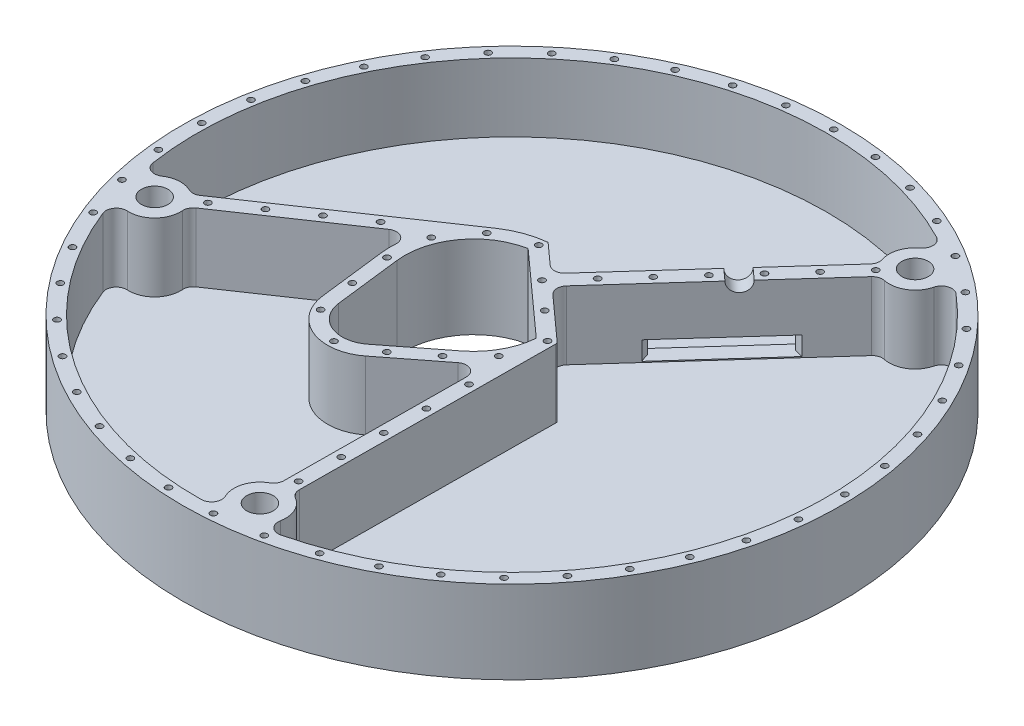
from build123d import *

# Parameters (mm, degrees)
SKETCH1_R                                        = 201.93
EXTRUDE1_DEPTH                                   = 50.8
SHELL2_T                                         = -8.89
SKETCH3_R                                        = 15.875
EXTRUDE2_DEPTH                                   = 50.8
EXTRUDE3_DEPTH                                   = 50.8
CSK_FOR_1_4_FLAT_HEAD_MACHINE_SCREW1_D           = 6.7564
CSK_FOR_1_4_FLAT_HEAD_MACHINE_SCREW1_CSINK_D     = 13.7610088
CSK_FOR_1_4_FLAT_HEAD_MACHINE_SCREW1_CSINK_ANGLE = 82
SKETCH8_R                                        = 8.128
CUT_EXTRUDE1_DEPTH                               = 25.4
FILLET1_R                                        = 6.35
CUT_EXTRUDE2_DEPTH                               = 6.35
CIRPATTERN1_COUNT                                = 45
LPATTERN1_COUNT                                  = 7
LPATTERN1_PITCH                                  = 24.13
LPATTERN2_COUNT                                  = 3
LPATTERN2_PITCH                                  = 22.8092
CIRPATTERN2_COUNT                                = 4
CIRPATTERN2_ANGLE                                = 90
F_10_24_TAPPED_HOLE5_D                           = 3.7973
F_10_24_TAPPED_HOLE5_DEPTH                       = 15.875
F_10_24_TAPPED_HOLE5_TIP                         = 1.140824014
F_10_24_TAPPED_HOLE6_D                           = 3.7973
F_10_24_TAPPED_HOLE6_DEPTH                       = 15.875
F_10_24_TAPPED_HOLE6_TIP                         = 1.140824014
F_10_24_TAPPED_HOLE7_D                           = 3.7973
F_10_24_TAPPED_HOLE7_DEPTH                       = 15.875
F_10_24_TAPPED_HOLE7_TIP                         = 1.140824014
LPATTERN3_COUNT                                  = 2
LPATTERN3_PITCH                                  = 5.08
CUT_EXTRUDE3_REACH                               = 312.437
SKETCH19_R                                       = 6.35


with BuildPart() as part:
    # Sketch1 → Extrude1 (new body)
    with BuildSketch(Plane(origin=(0, 0, 0), x_dir=(1, 0, 0), z_dir=(0, 1, 0))):
        with Locations(Location((0, 0, 0), (0, 0, 270))):
            Circle(SKETCH1_R)
        with BuildLine():
            Line((-28.742331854, -59.600703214), (3.565135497, -34.452889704))
            ThreePointArc((3.565135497, -34.452889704), (14.713381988, -21.319783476), (19.685, -4.826))
            Line((19.685, -4.826), (-30.409061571, 40.278895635))
            ThreePointArc((-30.409061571, 40.278895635), (-56.473748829, 23.694860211), (-64.257839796, -6.201729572))
            Line((-64.257839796, -6.201729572), (-59.356637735, -46.848539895))
            ThreePointArc((-59.356637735, -46.848539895), (-47.768699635, -62.153395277), (-28.742331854, -59.600703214))
        make_face(mode=Mode.SUBTRACT)
    extrude(amount=EXTRUDE1_DEPTH)

    # Shell2
    shell2_openings = [part.faces().sort_by_distance(p)[0] for p in [
        (0, 50.8, -196.218557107),
    ]]
    offset(amount=SHELL2_T, openings=shell2_openings, kind=Kind.INTERSECTION)

    # Sketch3 → Extrude2 (add)
    with BuildSketch(Plane(origin=(0, 50.8, 0), x_dir=(1, 0, 0), z_dir=(0, 1, 0))):
        with Locations((98.989124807, 148.001284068)):
            Circle(SKETCH3_R)
        with Locations((-172.232971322, -46.720317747)):
            Circle(SKETCH3_R)
        with Locations((22.585028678, -177.022317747)):
            Circle(SKETCH3_R)
    extrude(amount=-EXTRUDE2_DEPTH)

    # Sketch6 → Extrude3 (add)
    with BuildSketch(Plane(origin=(0, 0, 0), x_dir=(1, 0, 0), z_dir=(0, 1, 0))):
        Polygon((-10.103864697, 33.958689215), (85.316727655, 139.933993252), (92.395182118, 133.560524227), (-3.025410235, 27.58522019), align=None)
        Polygon((-51.014363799, 41.151219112), (-162.366417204, -34.283809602), (-157.024193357, -42.169636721), (-70.268175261, 16.602900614), align=None)
        Polygon((28.735263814, -1.012219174), (27.466763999, -161.916547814), (17.942059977, -161.841459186), (18.972068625, -31.188818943), align=None)
    extrude(amount=EXTRUDE3_DEPTH)

    # CSK for 1_4 Flat Head Machine Screw1 (through all)
    with Locations(Plane(origin=(22.585028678, 0, 177.022317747), x_dir=(0, 0, -1), z_dir=(0, -1, 0))):
        with Locations((0, 0), (130.302, -194.818), (325.023601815, 76.404096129)):
            CounterSinkHole(CSK_FOR_1_4_FLAT_HEAD_MACHINE_SCREW1_D / 2, CSK_FOR_1_4_FLAT_HEAD_MACHINE_SCREW1_CSINK_D / 2, counter_sink_angle=CSK_FOR_1_4_FLAT_HEAD_MACHINE_SCREW1_CSINK_ANGLE)

    # Sketch8 → Cut-Extrude1 (cut)
    with BuildSketch(Plane(origin=(0, 50.8, 0), x_dir=(1, 0, 0), z_dir=(0, 1, 0))):
        with Locations(Location((98.989124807, 148.001284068, 0), (0, 0, 270))):
            Circle(SKETCH8_R)
        with Locations(Location((22.585028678, -177.022317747, 0), (0, 0, 270))):
            Circle(SKETCH8_R)
        with Locations(Location((-172.232971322, -46.720317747, 0), (0, 0, 270))):
            Circle(SKETCH8_R)
    extrude(amount=-CUT_EXTRUDE1_DEPTH, mode=Mode.SUBTRACT)

    # Fillet1
    fillet1_edges = [part.edges().sort_by_distance(p)[0] for p in [
        (30.888171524, 29.845, 190.552781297),
        (17.945078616, 29.845, 192.204099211),
        (-70.268175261, 29.845, -16.602900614),
        (18.972068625, 29.845, 31.188818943),
        (-184.492696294, 29.845, 56.805691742),
        (-187.90868034, 29.845, 44.21277477),
        (102.744881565, 29.845, -163.425612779),
        (111.810638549, 29.845, -157.362075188),
        (85.316727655, 29.845, -139.933993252),
        (-162.366417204, 29.845, 34.283809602),
        (-10.103864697, 29.845, -33.958689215),
        (17.942059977, 29.845, 161.841459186),
        (27.466763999, 29.845, 161.916547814),
        (-3.025410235, 29.845, -27.58522019),
        (-157.024193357, 29.845, 42.169636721),
        (92.395182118, 29.845, -133.560524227),
    ]]
    fillet(fillet1_edges, radius=FILLET1_R)

    # Sketch10 → Cut-Extrude2 (cut)
    with BuildSketch(Plane(origin=(0, 15.875, 0), x_dir=(-1, 0, 0), z_dir=(0, 1, 0))):
        with BuildLine():
            ThreePointArc((-21.239017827, -61.651042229), (-86.279612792, -46.293923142), (-64.20802817, -109.372962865))
            ThreePointArc((-64.20802817, -109.372962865), (0.832566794, -124.730081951), (-21.239017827, -61.651042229))
        make_face()
    cut_extrude2 = extrude(amount=-CUT_EXTRUDE2_DEPTH, mode=Mode.SUBTRACT)

    # Sketch11 → 10-24 Tapped Hole1 (revolve, cut)
    with BuildSketch(Plane(origin=(0, 50.8, -197.1675), x_dir=(0, 0, 1), z_dir=(1, 0, 0))):
        Polygon((0, 0), (0, 17.015824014), (1.89865, 15.875), (1.89865, 0), align=None)
    f_10_24_tapped_hole1 = revolve(axis=Axis((0, 57.15, -197.1675), (0, -1, 0)), mode=Mode.SUBTRACT)

    # CirPattern1: 10-24 Tapped Hole1 ×45 about axis
    cirpattern1_axis = Axis((0, 0, 0), (0, 1, 0))
    for i in range(1, CIRPATTERN1_COUNT):
        add(f_10_24_tapped_hole1.rotate(cirpattern1_axis, i * 360 / CIRPATTERN1_COUNT), mode=Mode.SUBTRACT)

    # Sketch13 → 10-24 Tapped Hole2 (revolve, cut)
    with BuildSketch(Plane(origin=(-9.326474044, 50.8, -27.704624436), x_dir=(0, 0, 1), z_dir=(1, 0, 0))):
        Polygon((0, 0), (0, 17.015824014), (1.89865, 15.875), (1.89865, 0), align=None)
    f_10_24_tapped_hole2 = revolve(axis=Axis((-9.326474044, 57.15, -27.704624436), (0, -1, 0)), mode=Mode.SUBTRACT)

    # LPattern1: 10-24 Tapped Hole2 ×7
    with Locations(*[Vector(0.6691306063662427, 0, -0.7431448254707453) * (i * LPATTERN1_PITCH) for i in range(1, LPATTERN1_COUNT)]):
        add(f_10_24_tapped_hole2, mode=Mode.SUBTRACT)

    # LPattern2: 10-24 Tapped Hole2 ×3
    with Locations(*[Vector(0.7431448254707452, 0, 0.6691306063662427) * (i * LPATTERN2_PITCH) for i in range(1, LPATTERN2_COUNT)]):
        add(f_10_24_tapped_hole2, mode=Mode.SUBTRACT)

    # Sketch14 → 10-24 Tapped Hole3 (revolve, cut)
    with BuildSketch(Plane(origin=(-28.928706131, 50.8, -45.354553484), x_dir=(0, 0, 1), z_dir=(1, 0, 0))):
        Polygon((0, 0), (0, 17.015824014), (1.89865, 15.875), (1.89865, 0), align=None)
    f_10_24_tapped_hole3 = revolve(axis=Axis((-28.928706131, 57.15, -45.354553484), (0, -1, 0)), mode=Mode.SUBTRACT)

    # CirPattern2: 10-24 Tapped Hole3 ×4 about axis
    cirpattern2_axis = Axis((-22.35794811, 0, 1.149430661), (0, 1, 0))
    for i in range(1, CIRPATTERN2_COUNT):
        add(f_10_24_tapped_hole3.rotate(cirpattern2_axis, i * CIRPATTERN2_ANGLE / (CIRPATTERN2_COUNT - 1)), mode=Mode.SUBTRACT)

    # 10-24 Tapped Hole5
    with Locations(Plane(origin=(-65.961638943, 50.8, 31.854343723), x_dir=(0, 0, 1), z_dir=(0, 1, 0))):
        with Locations((0, 0), (23.88934862, 4.490897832), (36.524727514, 25.256647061), (26.02749522, 47.181000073), (11.096632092, 66.362722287), (-6.059051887, 83.583397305)):
            Hole(F_10_24_TAPPED_HOLE5_D / 2, depth=F_10_24_TAPPED_HOLE5_DEPTH)
            with Locations((0, 0, -(F_10_24_TAPPED_HOLE5_DEPTH + F_10_24_TAPPED_HOLE5_TIP / 2))):  # 118° drill point
                Cone(0, F_10_24_TAPPED_HOLE5_D / 2, F_10_24_TAPPED_HOLE5_TIP, mode=Mode.SUBTRACT)

    # 10-24 Tapped Hole6
    with Locations(Plane(origin=(23.587011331, 50.8, 49.924667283), x_dir=(0, 0, 1), z_dir=(0, 1, 0))):
        with Locations((0, 0), (25.907194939, -0.204241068), (51.814389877, -0.408482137), (77.721584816, -0.612723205), (103.628779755, -0.816964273)):
            Hole(F_10_24_TAPPED_HOLE6_D / 2, depth=F_10_24_TAPPED_HOLE6_DEPTH)
            with Locations((0, 0, -(F_10_24_TAPPED_HOLE6_DEPTH + F_10_24_TAPPED_HOLE6_TIP / 2))):  # 118° drill point
                Cone(0, F_10_24_TAPPED_HOLE6_D / 2, F_10_24_TAPPED_HOLE6_TIP, mode=Mode.SUBTRACT)

    # 10-24 Tapped Hole7
    with Locations(Plane(origin=(-152.802293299, 50.8, 33.557078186), x_dir=(0, 0, 1), z_dir=(0, 1, 0))):
        with Locations((0, 0), (-14.245930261, 21.028872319), (-28.491860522, 42.057744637), (-42.737790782, 63.086616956)):
            Hole(F_10_24_TAPPED_HOLE7_D / 2, depth=F_10_24_TAPPED_HOLE7_DEPTH)
            with Locations((0, 0, -(F_10_24_TAPPED_HOLE7_DEPTH + F_10_24_TAPPED_HOLE7_TIP / 2))):  # 118° drill point
                Cone(0, F_10_24_TAPPED_HOLE7_D / 2, F_10_24_TAPPED_HOLE7_TIP, mode=Mode.SUBTRACT)

    # LPattern3: Cut-Extrude2 ×2
    with Locations(*[(0, i * LPATTERN3_PITCH, 0) for i in range(1, LPATTERN3_COUNT)]):
        add(cut_extrude2, mode=Mode.SUBTRACT)

    # Sketch19 → Cut-Extrude3 (cut, up to next)
    with BuildSketch(Plane(origin=(-15.387878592, 0, -13.855308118), x_dir=(0.6691306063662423, 0, -0.7431448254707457), z_dir=(0.7431448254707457, 0, 0.6691306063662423)), mode=Mode.PRIVATE) as cut_extrude3_sk1:
        with Locations((99.825626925, 50.8)):
            Circle(SKETCH19_R)
    cut_extrude3_tool1 = extrude(cut_extrude3_sk1.sketch, amount=-CUT_EXTRUDE3_REACH, mode=Mode.PRIVATE) & part.part
    add(cut_extrude3_tool1.solids().sort_by_distance((51.408504, 50.8, -88.040206))[0], mode=Mode.SUBTRACT)


solid = part.part
